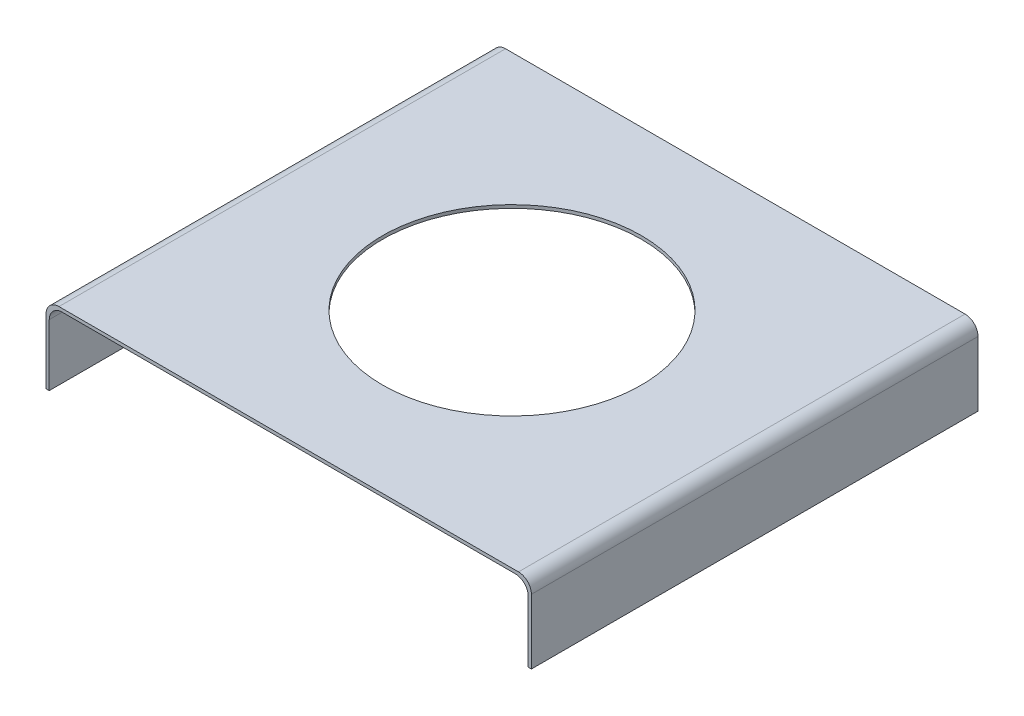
from build123d import *

# Parameters (mm, degrees)
BOSS_EXTRUDE1_DEPTH = 17.25
SKETCH2_R           = 10
CUT_EXTRUDE1_DEPTH  = 27.17489255
FILLET1_R           = 1


with BuildPart() as part:
    # Sketch1 → Boss-Extrude1 (new, symmetric)
    with BuildSketch(Plane.XY):
        Polygon((-18.75, 0), (18.75, 0), (18.75, -6), (18.5, -6), (18.5, -0.25), (-18.5, -0.25), (-18.5, -6), (-18.75, -6), align=None)
    extrude(amount=BOSS_EXTRUDE1_DEPTH, both=True)

    # Sketch2 → Cut-Extrude1 (cut, through all)
    with BuildSketch(Plane(origin=(0, 0, 0), x_dir=(1, 0, 0), z_dir=(0, 1, 0))):
        with Locations(Location((0, 0, 0), (0, 0, 270))):
            Circle(SKETCH2_R)
    extrude(amount=-CUT_EXTRUDE1_DEPTH, mode=Mode.SUBTRACT)

    # Fillet1
    fillet1_edges = [part.edges().sort_by_distance(p)[0] for p in [
        (-18.75, 0, 0),
        (18.75, 0, 0),
        (18.5, -0.25, 0),
        (-18.5, -0.25, 0),
    ]]
    fillet(fillet1_edges, radius=FILLET1_R)


solid = part.part
